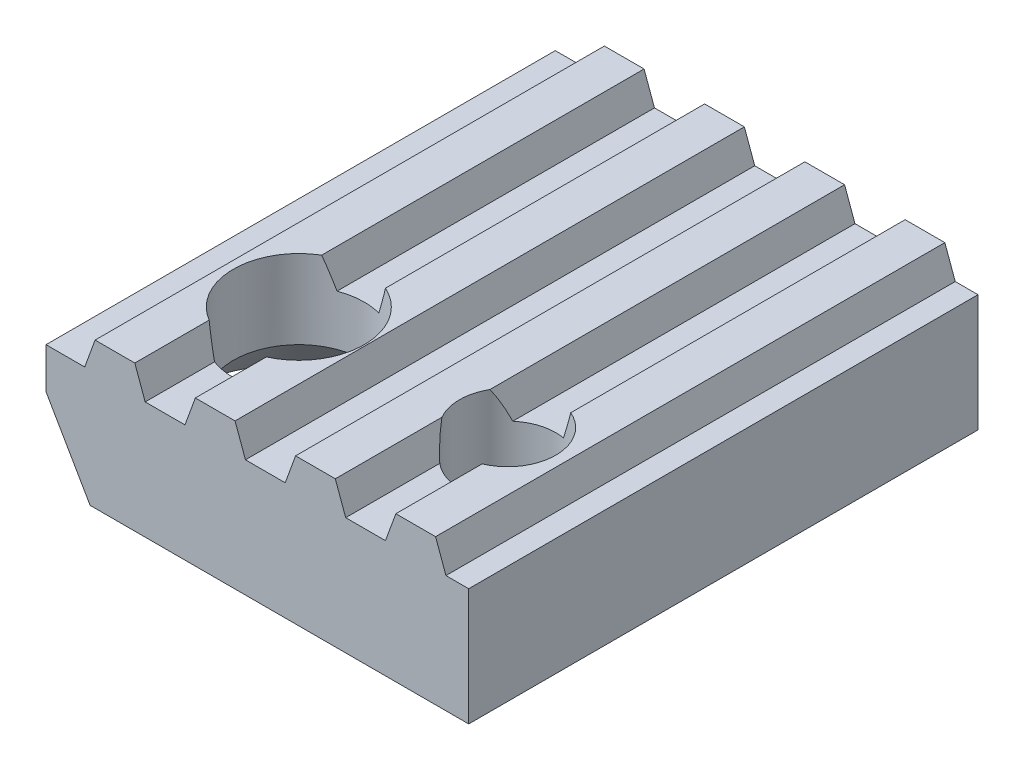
ISO-10303-21;
HEADER;
FILE_DESCRIPTION(('STEP AP214'),'2;1');
FILE_NAME('part.step','',(''),(''),'','','');
FILE_SCHEMA(('AUTOMOTIVE_DESIGN { 1 0 10303 214 1 1 1 1 }'));
ENDSEC;
DATA;
#1=APPLICATION_CONTEXT('core data for automotive mechanical design processes');
#2=APPLICATION_PROTOCOL_DEFINITION('international standard','automotive_design',2000,#1);
#3=PRODUCT_CONTEXT('',#1,'mechanical');
#4=PRODUCT('Part','Part','',(#3));
#5=PRODUCT_RELATED_PRODUCT_CATEGORY('part','',(#4));
#6=PRODUCT_DEFINITION_FORMATION('','',#4);
#7=PRODUCT_DEFINITION_CONTEXT('part definition',#1,'design');
#8=PRODUCT_DEFINITION('design','',#6,#7);
#9=PRODUCT_DEFINITION_SHAPE('','',#8);
#10=(LENGTH_UNIT() NAMED_UNIT(*) SI_UNIT(.MILLI.,.METRE.));
#11=(NAMED_UNIT(*) PLANE_ANGLE_UNIT() SI_UNIT($,.RADIAN.));
#12=(NAMED_UNIT(*) SI_UNIT($,.STERADIAN.) SOLID_ANGLE_UNIT());
#13=UNCERTAINTY_MEASURE_WITH_UNIT(LENGTH_MEASURE(1.E-05),#10,'distance_accuracy_value','');
#14=(GEOMETRIC_REPRESENTATION_CONTEXT(3) GLOBAL_UNCERTAINTY_ASSIGNED_CONTEXT((#13)) GLOBAL_UNIT_ASSIGNED_CONTEXT((#10,
#11,#12)) REPRESENTATION_CONTEXT('',''));
#15=CARTESIAN_POINT('',(0.,0.,0.));
#16=DIRECTION('',(0.,0.,1.));
#17=DIRECTION('',(1.,0.,0.));
#18=AXIS2_PLACEMENT_3D('',#15,#16,#17);
#19=CARTESIAN_POINT('',(0.,0.,12.7));
#20=DIRECTION('',(0.,1.,0.));
#21=DIRECTION('',(0.,0.,0.999999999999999));
#22=AXIS2_PLACEMENT_3D('',#19,#20,#21);
#23=PLANE('',#22);
#24=CARTESIAN_POINT('',(3.04799999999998,0.,9.44359999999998));
#25=DIRECTION('',(0.,1.,0.));
#26=DIRECTION('',(0.,0.,0.999999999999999));
#27=AXIS2_PLACEMENT_3D('',#24,#25,#26);
#28=CIRCLE('',#27,1.63195);
#29=CARTESIAN_POINT('',(3.46520000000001,0.,7.86587855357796));
#30=VERTEX_POINT('',#29);
#31=CARTESIAN_POINT('',(2.47351126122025,0.,7.91611072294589));
#32=VERTEX_POINT('',#31);
#33=EDGE_CURVE('E276',#30,#32,#28,.T.);
#34=ORIENTED_EDGE('',*,*,#33,.F.);
#35=DIRECTION('',(0.,0.,-0.999999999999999));
#36=VECTOR('',#35,1.);
#37=CARTESIAN_POINT('',(3.46519999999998,0.,12.7));
#38=LINE('',#37,#36);
#39=CARTESIAN_POINT('',(3.4652,0.,0.));
#40=VERTEX_POINT('',#39);
#41=EDGE_CURVE('E520',#30,#40,#38,.T.);
#42=ORIENTED_EDGE('',*,*,#41,.T.);
#43=DIRECTION('',(-1.,0.,0.));
#44=VECTOR('',#43,1.);
#45=CARTESIAN_POINT('',(0.,0.,0.));
#46=LINE('',#45,#44);
#47=CARTESIAN_POINT('',(2.47351126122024,0.,0.));
#48=VERTEX_POINT('',#47);
#49=EDGE_CURVE('E567',#40,#48,#46,.T.);
#50=ORIENTED_EDGE('',*,*,#49,.T.);
#51=DIRECTION('',(0.,0.,-0.999999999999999));
#52=VECTOR('',#51,1.);
#53=CARTESIAN_POINT('',(2.47351126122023,0.,12.7));
#54=LINE('',#53,#52);
#55=EDGE_CURVE('E292',#32,#48,#54,.T.);
#56=ORIENTED_EDGE('',*,*,#55,.F.);
#57=EDGE_LOOP('',(#34,#42,#50,#56));
#58=FACE_BOUND('',#57,.T.);
#59=ADVANCED_FACE('F67',(#58),#23,.T.);
#60=CARTESIAN_POINT('',(2.21465563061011,0.711200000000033,12.7));
#61=DIRECTION('',(-0.93969262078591,-0.342020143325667,0.));
#62=DIRECTION('',(0.342020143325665,-0.939692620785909,0.));
#63=AXIS2_PLACEMENT_3D('',#60,#61,#62);
#64=PLANE('',#63);
#65=CARTESIAN_POINT('',(2.47351126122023,0.,12.7));
#66=VERTEX_POINT('',#65);
#67=CARTESIAN_POINT('',(2.47351126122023,0.,10.9710892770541));
#68=VERTEX_POINT('',#67);
#69=EDGE_CURVE('E283',#66,#68,#54,.T.);
#70=ORIENTED_EDGE('',*,*,#69,.T.);
#71=CARTESIAN_POINT('',(3.04799999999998,-1.57839483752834,9.44359999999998));
#72=DIRECTION('',(-0.93969262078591,-0.342020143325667,0.));
#73=DIRECTION('',(0.342020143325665,-0.939692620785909,0.));
#74=AXIS2_PLACEMENT_3D('',#71,#72,#73);
#75=ELLIPSE('',#74,4.77150259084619,1.63195);
#76=CARTESIAN_POINT('',(2.21465563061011,0.711200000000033,10.8467386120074));
#77=VERTEX_POINT('',#76);
#78=EDGE_CURVE('E265',#68,#77,#75,.T.);
#79=ORIENTED_EDGE('',*,*,#78,.T.);
#80=DIRECTION('',(0.,0.,-0.999999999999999));
#81=VECTOR('',#80,1.);
#82=CARTESIAN_POINT('',(2.21465563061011,0.711200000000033,12.7));
#83=LINE('',#82,#81);
#84=CARTESIAN_POINT('',(2.21465563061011,0.711200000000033,12.7));
#85=VERTEX_POINT('',#84);
#86=EDGE_CURVE('E297',#85,#77,#83,.T.);
#87=ORIENTED_EDGE('',*,*,#86,.F.);
#88=DIRECTION('',(-0.342020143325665,0.939692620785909,0.));
#89=VECTOR('',#88,1.);
#90=CARTESIAN_POINT('',(2.21465563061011,0.711200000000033,12.7));
#91=LINE('',#90,#89);
#92=EDGE_CURVE('E290',#66,#85,#91,.T.);
#93=ORIENTED_EDGE('',*,*,#92,.F.);
#94=EDGE_LOOP('',(#70,#79,#87,#93));
#95=FACE_BOUND('',#94,.T.);
#96=ADVANCED_FACE('F289',(#95),#64,.F.);
#97=CARTESIAN_POINT('',(3.46519999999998,0.,12.7));
#98=DIRECTION('',(0.939692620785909,-0.342020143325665,0.));
#99=DIRECTION('',(0.342020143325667,0.93969262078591,0.));
#100=AXIS2_PLACEMENT_3D('',#97,#98,#99);
#101=PLANE('',#100);
#102=ORIENTED_EDGE('',*,*,#41,.F.);
#103=CARTESIAN_POINT('',(3.04799999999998,-1.14624757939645,9.44359999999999));
#104=DIRECTION('',(0.939692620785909,-0.342020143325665,0.));
#105=DIRECTION('',(-0.342020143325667,-0.93969262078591,0.));
#106=AXIS2_PLACEMENT_3D('',#103,#104,#105);
#107=ELLIPSE('',#106,4.77150259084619,1.63195);
#108=CARTESIAN_POINT('',(3.72405563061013,0.711200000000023,7.95826852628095));
#109=VERTEX_POINT('',#108);
#110=EDGE_CURVE('E316',#30,#109,#107,.T.);
#111=ORIENTED_EDGE('',*,*,#110,.T.);
#112=DIRECTION('',(0.,0.,-0.999999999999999));
#113=VECTOR('',#112,1.);
#114=CARTESIAN_POINT('',(3.72405563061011,0.71120000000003,12.7));
#115=LINE('',#114,#113);
#116=CARTESIAN_POINT('',(3.72405563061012,0.711200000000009,0.));
#117=VERTEX_POINT('',#116);
#118=EDGE_CURVE('E522',#109,#117,#115,.T.);
#119=ORIENTED_EDGE('',*,*,#118,.T.);
#120=DIRECTION('',(-0.342020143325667,-0.93969262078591,0.));
#121=VECTOR('',#120,1.);
#122=CARTESIAN_POINT('',(3.4652,0.,0.));
#123=LINE('',#122,#121);
#124=EDGE_CURVE('E510',#117,#40,#123,.T.);
#125=ORIENTED_EDGE('',*,*,#124,.T.);
#126=EDGE_LOOP('',(#102,#111,#119,#125));
#127=FACE_BOUND('',#126,.T.);
#128=ADVANCED_FACE('F374',(#127),#101,.F.);
#129=CARTESIAN_POINT('',(8.25499999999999,0.,9.44359999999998));
#130=DIRECTION('',(0.,1.,0.));
#131=DIRECTION('',(0.,0.,0.999999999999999));
#132=AXIS2_PLACEMENT_3D('',#129,#130,#131);
#133=CIRCLE('',#132,1.20015);
#134=CARTESIAN_POINT('',(8.4652,0.,8.26200109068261));
#135=VERTEX_POINT('',#134);
#136=CARTESIAN_POINT('',(7.47351126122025,0.,8.53275677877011));
#137=VERTEX_POINT('',#136);
#138=EDGE_CURVE('E611',#135,#137,#133,.T.);
#139=ORIENTED_EDGE('',*,*,#138,.F.);
#140=DIRECTION('',(0.,0.,-0.999999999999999));
#141=VECTOR('',#140,1.);
#142=CARTESIAN_POINT('',(8.46519999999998,0.,12.7));
#143=LINE('',#142,#141);
#144=CARTESIAN_POINT('',(8.4652,0.,0.));
#145=VERTEX_POINT('',#144);
#146=EDGE_CURVE('E880',#135,#145,#143,.T.);
#147=ORIENTED_EDGE('',*,*,#146,.T.);
#148=CARTESIAN_POINT('',(7.47351126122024,0.,0.));
#149=VERTEX_POINT('',#148);
#150=EDGE_CURVE('E457',#145,#149,#46,.T.);
#151=ORIENTED_EDGE('',*,*,#150,.T.);
#152=DIRECTION('',(0.,0.,-0.999999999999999));
#153=VECTOR('',#152,1.);
#154=CARTESIAN_POINT('',(7.47351126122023,0.,12.7));
#155=LINE('',#154,#153);
#156=EDGE_CURVE('E501',#137,#149,#155,.T.);
#157=ORIENTED_EDGE('',*,*,#156,.F.);
#158=EDGE_LOOP('',(#139,#147,#151,#157));
#159=FACE_BOUND('',#158,.T.);
#160=ADVANCED_FACE('F424',(#159),#23,.T.);
#161=CARTESIAN_POINT('',(7.2146556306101,0.71120000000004,12.7));
#162=DIRECTION('',(-0.93969262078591,-0.342020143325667,0.));
#163=DIRECTION('',(0.342020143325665,-0.939692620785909,0.));
#164=AXIS2_PLACEMENT_3D('',#161,#162,#163);
#165=PLANE('',#164);
#166=CARTESIAN_POINT('',(7.47351126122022,0.,12.7));
#167=VERTEX_POINT('',#166);
#168=CARTESIAN_POINT('',(7.47351126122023,0.,10.3544432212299));
#169=VERTEX_POINT('',#168);
#170=EDGE_CURVE('E502',#167,#169,#155,.T.);
#171=ORIENTED_EDGE('',*,*,#170,.T.);
#172=CARTESIAN_POINT('',(8.25499999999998,-2.14712266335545,9.44359999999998));
#173=DIRECTION('',(-0.93969262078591,-0.342020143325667,0.));
#174=DIRECTION('',(0.342020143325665,-0.939692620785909,0.));
#175=AXIS2_PLACEMENT_3D('',#172,#173,#174);
#176=ELLIPSE('',#175,3.50900385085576,1.20015);
#177=CARTESIAN_POINT('',(7.2146556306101,0.71120000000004,10.0419674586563));
#178=VERTEX_POINT('',#177);
#179=EDGE_CURVE('E613',#169,#178,#176,.T.);
#180=ORIENTED_EDGE('',*,*,#179,.T.);
#181=DIRECTION('',(0.,0.,-0.999999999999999));
#182=VECTOR('',#181,1.);
#183=CARTESIAN_POINT('',(7.2146556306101,0.71120000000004,12.7));
#184=LINE('',#183,#182);
#185=CARTESIAN_POINT('',(7.2146556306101,0.71120000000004,12.7));
#186=VERTEX_POINT('',#185);
#187=EDGE_CURVE('E498',#186,#178,#184,.T.);
#188=ORIENTED_EDGE('',*,*,#187,.F.);
#189=DIRECTION('',(-0.342020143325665,0.939692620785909,0.));
#190=VECTOR('',#189,1.);
#191=CARTESIAN_POINT('',(7.2146556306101,0.71120000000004,12.7));
#192=LINE('',#191,#190);
#193=EDGE_CURVE('E484',#167,#186,#192,.T.);
#194=ORIENTED_EDGE('',*,*,#193,.F.);
#195=EDGE_LOOP('',(#171,#180,#188,#194));
#196=FACE_BOUND('',#195,.T.);
#197=ADVANCED_FACE('F369',(#196),#165,.F.);
#198=CARTESIAN_POINT('',(8.46519999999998,0.,12.7));
#199=DIRECTION('',(0.939692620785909,-0.342020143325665,0.));
#200=DIRECTION('',(0.342020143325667,0.93969262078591,0.));
#201=AXIS2_PLACEMENT_3D('',#198,#199,#200);
#202=PLANE('',#201);
#203=ORIENTED_EDGE('',*,*,#146,.F.);
#204=CARTESIAN_POINT('',(8.25499999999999,-0.577519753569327,9.44359999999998));
#205=DIRECTION('',(0.939692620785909,-0.342020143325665,0.));
#206=DIRECTION('',(-0.342020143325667,-0.93969262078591,0.));
#207=AXIS2_PLACEMENT_3D('',#204,#205,#206);
#208=ELLIPSE('',#207,3.50900385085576,1.20015);
#209=CARTESIAN_POINT('',(8.72405563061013,0.711200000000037,8.33890690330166));
#210=VERTEX_POINT('',#209);
#211=EDGE_CURVE('E295',#135,#210,#208,.T.);
#212=ORIENTED_EDGE('',*,*,#211,.T.);
#213=DIRECTION('',(0.,0.,-0.999999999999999));
#214=VECTOR('',#213,1.);
#215=CARTESIAN_POINT('',(8.7240556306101,0.711200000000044,12.7));
#216=LINE('',#215,#214);
#217=CARTESIAN_POINT('',(8.72405563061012,0.711200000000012,0.));
#218=VERTEX_POINT('',#217);
#219=EDGE_CURVE('E886',#210,#218,#216,.T.);
#220=ORIENTED_EDGE('',*,*,#219,.T.);
#221=DIRECTION('',(-0.342020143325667,-0.93969262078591,0.));
#222=VECTOR('',#221,1.);
#223=CARTESIAN_POINT('',(8.4652,0.,0.));
#224=LINE('',#223,#222);
#225=EDGE_CURVE('E874',#218,#145,#224,.T.);
#226=ORIENTED_EDGE('',*,*,#225,.T.);
#227=EDGE_LOOP('',(#203,#212,#220,#226));
#228=FACE_BOUND('',#227,.T.);
#229=ADVANCED_FACE('F348',(#228),#202,.F.);
#230=CARTESIAN_POINT('',(10.541,0.,0.));
#231=VERTEX_POINT('',#230);
#232=CARTESIAN_POINT('',(9.97351126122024,0.,0.));
#233=VERTEX_POINT('',#232);
#234=EDGE_CURVE('E449',#231,#233,#46,.T.);
#235=ORIENTED_EDGE('',*,*,#234,.T.);
#236=DIRECTION('',(0.,0.,-0.999999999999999));
#237=VECTOR('',#236,1.);
#238=CARTESIAN_POINT('',(9.97351126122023,0.,12.7));
#239=LINE('',#238,#237);
#240=CARTESIAN_POINT('',(9.97351126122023,0.,12.7));
#241=VERTEX_POINT('',#240);
#242=EDGE_CURVE('E452',#241,#233,#239,.T.);
#243=ORIENTED_EDGE('',*,*,#242,.F.);
#244=DIRECTION('',(1.,0.,0.));
#245=VECTOR('',#244,1.);
#246=CARTESIAN_POINT('',(0.,0.,12.7));
#247=LINE('',#246,#245);
#248=CARTESIAN_POINT('',(10.541,0.,12.7));
#249=VERTEX_POINT('',#248);
#250=EDGE_CURVE('E534',#241,#249,#247,.T.);
#251=ORIENTED_EDGE('',*,*,#250,.T.);
#252=DIRECTION('',(0.,0.,-0.999999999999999));
#253=VECTOR('',#252,1.);
#254=CARTESIAN_POINT('',(10.541,0.,0.));
#255=LINE('',#254,#253);
#256=EDGE_CURVE('E455',#249,#231,#255,.T.);
#257=ORIENTED_EDGE('',*,*,#256,.T.);
#258=EDGE_LOOP('',(#235,#243,#251,#257));
#259=FACE_BOUND('',#258,.T.);
#260=ADVANCED_FACE('F430',(#259),#23,.T.);
#261=CARTESIAN_POINT('',(8.46519999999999,0.,10.6251989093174));
#262=VERTEX_POINT('',#261);
#263=EDGE_CURVE('E606',#169,#262,#133,.T.);
#264=ORIENTED_EDGE('',*,*,#263,.F.);
#265=ORIENTED_EDGE('',*,*,#170,.F.);
#266=CARTESIAN_POINT('',(8.46519999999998,0.,12.7));
#267=VERTEX_POINT('',#266);
#268=EDGE_CURVE('E552',#167,#267,#247,.T.);
#269=ORIENTED_EDGE('',*,*,#268,.T.);
#270=EDGE_CURVE('E884',#267,#262,#143,.T.);
#271=ORIENTED_EDGE('',*,*,#270,.T.);
#272=EDGE_LOOP('',(#264,#265,#269,#271));
#273=FACE_BOUND('',#272,.T.);
#274=ADVANCED_FACE('F439',(#273),#23,.T.);
#275=CARTESIAN_POINT('',(4.97351126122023,0.,12.7));
#276=VERTEX_POINT('',#275);
#277=CARTESIAN_POINT('',(5.96519999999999,0.,12.7));
#278=VERTEX_POINT('',#277);
#279=EDGE_CURVE('E549',#276,#278,#247,.T.);
#280=ORIENTED_EDGE('',*,*,#279,.T.);
#281=DIRECTION('',(0.,0.,-0.999999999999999));
#282=VECTOR('',#281,1.);
#283=CARTESIAN_POINT('',(5.96519999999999,0.,12.7));
#284=LINE('',#283,#282);
#285=CARTESIAN_POINT('',(5.9652,0.,0.));
#286=VERTEX_POINT('',#285);
#287=EDGE_CURVE('E491',#278,#286,#284,.T.);
#288=ORIENTED_EDGE('',*,*,#287,.T.);
#289=CARTESIAN_POINT('',(4.97351126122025,0.,0.));
#290=VERTEX_POINT('',#289);
#291=EDGE_CURVE('E555',#286,#290,#46,.T.);
#292=ORIENTED_EDGE('',*,*,#291,.T.);
#293=DIRECTION('',(0.,0.,-0.999999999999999));
#294=VECTOR('',#293,1.);
#295=CARTESIAN_POINT('',(4.97351126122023,0.,12.7));
#296=LINE('',#295,#294);
#297=EDGE_CURVE('E528',#276,#290,#296,.T.);
#298=ORIENTED_EDGE('',*,*,#297,.F.);
#299=EDGE_LOOP('',(#280,#288,#292,#298));
#300=FACE_BOUND('',#299,.T.);
#301=ADVANCED_FACE('F419',(#300),#23,.T.);
#302=CARTESIAN_POINT('',(3.46519999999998,0.,11.021321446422));
#303=VERTEX_POINT('',#302);
#304=EDGE_CURVE('E268',#68,#303,#28,.T.);
#305=ORIENTED_EDGE('',*,*,#304,.F.);
#306=ORIENTED_EDGE('',*,*,#69,.F.);
#307=CARTESIAN_POINT('',(3.46519999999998,0.,12.7));
#308=VERTEX_POINT('',#307);
#309=EDGE_CURVE('E541',#66,#308,#247,.T.);
#310=ORIENTED_EDGE('',*,*,#309,.T.);
#311=EDGE_CURVE('E286',#308,#303,#38,.T.);
#312=ORIENTED_EDGE('',*,*,#311,.T.);
#313=EDGE_LOOP('',(#305,#306,#310,#312));
#314=FACE_BOUND('',#313,.T.);
#315=ADVANCED_FACE('F282',(#314),#23,.T.);
#316=CARTESIAN_POINT('',(2.21465563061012,0.711200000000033,8.04046138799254));
#317=VERTEX_POINT('',#316);
#318=CARTESIAN_POINT('',(2.21465563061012,0.711200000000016,0.));
#319=VERTEX_POINT('',#318);
#320=EDGE_CURVE('E860',#317,#319,#83,.T.);
#321=ORIENTED_EDGE('',*,*,#320,.F.);
#322=EDGE_CURVE('E278',#317,#32,#75,.T.);
#323=ORIENTED_EDGE('',*,*,#322,.T.);
#324=ORIENTED_EDGE('',*,*,#55,.T.);
#325=DIRECTION('',(-0.342020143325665,0.939692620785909,0.));
#326=VECTOR('',#325,1.);
#327=CARTESIAN_POINT('',(2.21465563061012,0.711200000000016,0.));
#328=LINE('',#327,#326);
#329=EDGE_CURVE('E304',#48,#319,#328,.T.);
#330=ORIENTED_EDGE('',*,*,#329,.T.);
#331=EDGE_LOOP('',(#321,#323,#324,#330));
#332=FACE_BOUND('',#331,.T.);
#333=ADVANCED_FACE('F412',(#332),#64,.F.);
#334=CARTESIAN_POINT('',(1.2240556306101,0.711200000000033,12.7));
#335=DIRECTION('',(0.,-1.,0.));
#336=DIRECTION('',(0.,0.,-0.999999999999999));
#337=AXIS2_PLACEMENT_3D('',#334,#335,#336);
#338=PLANE('',#337);
#339=ORIENTED_EDGE('',*,*,#86,.T.);
#340=CARTESIAN_POINT('',(3.04799999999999,0.711200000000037,9.44359999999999));
#341=DIRECTION('',(0.,-1.,0.));
#342=DIRECTION('',(0.,0.,-0.999999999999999));
#343=AXIS2_PLACEMENT_3D('',#340,#341,#342);
#344=CIRCLE('',#343,1.63195);
#345=EDGE_CURVE('E271',#77,#317,#344,.T.);
#346=ORIENTED_EDGE('',*,*,#345,.T.);
#347=ORIENTED_EDGE('',*,*,#320,.T.);
#348=DIRECTION('',(-1.,0.,0.));
#349=VECTOR('',#348,1.);
#350=CARTESIAN_POINT('',(1.22405563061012,0.711200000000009,0.));
#351=LINE('',#350,#349);
#352=CARTESIAN_POINT('',(1.22405563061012,0.711200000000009,0.));
#353=VERTEX_POINT('',#352);
#354=EDGE_CURVE('E838',#319,#353,#351,.T.);
#355=ORIENTED_EDGE('',*,*,#354,.T.);
#356=DIRECTION('',(0.,0.,-0.999999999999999));
#357=VECTOR('',#356,1.);
#358=CARTESIAN_POINT('',(1.2240556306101,0.711200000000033,12.7));
#359=LINE('',#358,#357);
#360=CARTESIAN_POINT('',(1.2240556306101,0.711200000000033,12.7));
#361=VERTEX_POINT('',#360);
#362=EDGE_CURVE('E859',#361,#353,#359,.T.);
#363=ORIENTED_EDGE('',*,*,#362,.F.);
#364=DIRECTION('',(-1.,0.,0.));
#365=VECTOR('',#364,1.);
#366=CARTESIAN_POINT('',(1.2240556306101,0.711200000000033,12.7));
#367=LINE('',#366,#365);
#368=EDGE_CURVE('E853',#85,#361,#367,.T.);
#369=ORIENTED_EDGE('',*,*,#368,.F.);
#370=EDGE_LOOP('',(#339,#346,#347,#355,#363,#369));
#371=FACE_BOUND('',#370,.T.);
#372=ADVANCED_FACE('F409',(#371),#338,.F.);
#373=CARTESIAN_POINT('',(0.965199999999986,0.,12.7));
#374=DIRECTION('',(0.939692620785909,-0.342020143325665,0.));
#375=DIRECTION('',(0.342020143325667,0.93969262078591,0.));
#376=AXIS2_PLACEMENT_3D('',#373,#374,#375);
#377=PLANE('',#376);
#378=DIRECTION('',(-0.342020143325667,-0.93969262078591,0.));
#379=VECTOR('',#378,1.);
#380=CARTESIAN_POINT('',(0.965200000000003,0.,0.));
#381=LINE('',#380,#379);
#382=CARTESIAN_POINT('',(0.965200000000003,0.,0.));
#383=VERTEX_POINT('',#382);
#384=EDGE_CURVE('E858',#353,#383,#381,.T.);
#385=ORIENTED_EDGE('',*,*,#384,.T.);
#386=DIRECTION('',(0.,0.,-0.999999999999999));
#387=VECTOR('',#386,1.);
#388=CARTESIAN_POINT('',(0.965199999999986,0.,12.7));
#389=LINE('',#388,#387);
#390=CARTESIAN_POINT('',(0.965199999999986,0.,12.7));
#391=VERTEX_POINT('',#390);
#392=EDGE_CURVE('E310',#391,#383,#389,.T.);
#393=ORIENTED_EDGE('',*,*,#392,.F.);
#394=DIRECTION('',(-0.342020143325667,-0.93969262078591,0.));
#395=VECTOR('',#394,1.);
#396=CARTESIAN_POINT('',(0.965199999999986,0.,12.7));
#397=LINE('',#396,#395);
#398=EDGE_CURVE('E850',#361,#391,#397,.T.);
#399=ORIENTED_EDGE('',*,*,#398,.F.);
#400=ORIENTED_EDGE('',*,*,#362,.T.);
#401=EDGE_LOOP('',(#385,#393,#399,#400));
#402=FACE_BOUND('',#401,.T.);
#403=ADVANCED_FACE('F405',(#402),#377,.F.);
#404=CARTESIAN_POINT('',(0.965199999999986,0.,12.7));
#405=DIRECTION('',(0.,0.,0.999999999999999));
#406=DIRECTION('',(1.,0.,0.));
#407=AXIS2_PLACEMENT_3D('',#404,#405,#406);
#408=PLANE('',#407);
#409=DIRECTION('',(0.,1.,0.));
#410=VECTOR('',#409,1.);
#411=CARTESIAN_POINT('',(0.,-2.92099999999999,12.7));
#412=LINE('',#411,#410);
#413=CARTESIAN_POINT('',(0.,-1.01599999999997,12.7));
#414=VERTEX_POINT('',#413);
#415=CARTESIAN_POINT('',(0.,0.,12.7));
#416=VERTEX_POINT('',#415);
#417=EDGE_CURVE('E844',#414,#416,#412,.T.);
#418=ORIENTED_EDGE('',*,*,#417,.F.);
#419=DIRECTION('',(0.499999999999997,-0.86602540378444,0.));
#420=VECTOR('',#419,1.);
#421=CARTESIAN_POINT('',(-0.198640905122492,-0.671943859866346,12.7));
#422=LINE('',#421,#420);
#423=CARTESIAN_POINT('',(1.09985226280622,-2.92099999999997,12.7));
#424=VERTEX_POINT('',#423);
#425=EDGE_CURVE('E326',#414,#424,#422,.T.);
#426=ORIENTED_EDGE('',*,*,#425,.T.);
#427=DIRECTION('',(1.,0.,0.));
#428=VECTOR('',#427,1.);
#429=CARTESIAN_POINT('',(0.,-2.92099999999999,12.7));
#430=LINE('',#429,#428);
#431=CARTESIAN_POINT('',(10.541,-2.92099999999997,12.7));
#432=VERTEX_POINT('',#431);
#433=EDGE_CURVE('E456',#424,#432,#430,.T.);
#434=ORIENTED_EDGE('',*,*,#433,.T.);
#435=DIRECTION('',(0.,1.,0.));
#436=VECTOR('',#435,1.);
#437=CARTESIAN_POINT('',(10.541,-2.92099999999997,12.7));
#438=LINE('',#437,#436);
#439=EDGE_CURVE('E839',#432,#249,#438,.T.);
#440=ORIENTED_EDGE('',*,*,#439,.T.);
#441=ORIENTED_EDGE('',*,*,#250,.F.);
#442=DIRECTION('',(-0.342020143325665,0.939692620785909,0.));
#443=VECTOR('',#442,1.);
#444=CARTESIAN_POINT('',(9.71465563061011,0.71120000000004,12.7));
#445=LINE('',#444,#443);
#446=CARTESIAN_POINT('',(9.71465563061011,0.71120000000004,12.7));
#447=VERTEX_POINT('',#446);
#448=EDGE_CURVE('E469',#241,#447,#445,.T.);
#449=ORIENTED_EDGE('',*,*,#448,.T.);
#450=DIRECTION('',(-1.,0.,0.));
#451=VECTOR('',#450,1.);
#452=CARTESIAN_POINT('',(8.7240556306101,0.711200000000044,12.7));
#453=LINE('',#452,#451);
#454=CARTESIAN_POINT('',(8.7240556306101,0.711200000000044,12.7));
#455=VERTEX_POINT('',#454);
#456=EDGE_CURVE('E872',#447,#455,#453,.T.);
#457=ORIENTED_EDGE('',*,*,#456,.T.);
#458=DIRECTION('',(-0.342020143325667,-0.93969262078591,0.));
#459=VECTOR('',#458,1.);
#460=CARTESIAN_POINT('',(8.46519999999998,0.,12.7));
#461=LINE('',#460,#459);
#462=EDGE_CURVE('E878',#455,#267,#461,.T.);
#463=ORIENTED_EDGE('',*,*,#462,.T.);
#464=ORIENTED_EDGE('',*,*,#268,.F.);
#465=ORIENTED_EDGE('',*,*,#193,.T.);
#466=DIRECTION('',(-1.,0.,0.));
#467=VECTOR('',#466,1.);
#468=CARTESIAN_POINT('',(6.22405563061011,0.711200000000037,12.7));
#469=LINE('',#468,#467);
#470=CARTESIAN_POINT('',(6.22405563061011,0.711200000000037,12.7));
#471=VERTEX_POINT('',#470);
#472=EDGE_CURVE('E486',#186,#471,#469,.T.);
#473=ORIENTED_EDGE('',*,*,#472,.T.);
#474=DIRECTION('',(-0.342020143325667,-0.93969262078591,0.));
#475=VECTOR('',#474,1.);
#476=CARTESIAN_POINT('',(5.96519999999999,0.,12.7));
#477=LINE('',#476,#475);
#478=EDGE_CURVE('E488',#471,#278,#477,.T.);
#479=ORIENTED_EDGE('',*,*,#478,.T.);
#480=ORIENTED_EDGE('',*,*,#279,.F.);
#481=DIRECTION('',(-0.342020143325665,0.939692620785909,0.));
#482=VECTOR('',#481,1.);
#483=CARTESIAN_POINT('',(4.71465563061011,0.71120000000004,12.7));
#484=LINE('',#483,#482);
#485=CARTESIAN_POINT('',(4.71465563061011,0.71120000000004,12.7));
#486=VERTEX_POINT('',#485);
#487=EDGE_CURVE('E513',#276,#486,#484,.T.);
#488=ORIENTED_EDGE('',*,*,#487,.T.);
#489=DIRECTION('',(-1.,0.,0.));
#490=VECTOR('',#489,1.);
#491=CARTESIAN_POINT('',(3.72405563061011,0.71120000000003,12.7));
#492=LINE('',#491,#490);
#493=CARTESIAN_POINT('',(3.72405563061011,0.71120000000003,12.7));
#494=VERTEX_POINT('',#493);
#495=EDGE_CURVE('E515',#486,#494,#492,.T.);
#496=ORIENTED_EDGE('',*,*,#495,.T.);
#497=DIRECTION('',(-0.342020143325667,-0.93969262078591,0.));
#498=VECTOR('',#497,1.);
#499=CARTESIAN_POINT('',(3.46519999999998,0.,12.7));
#500=LINE('',#499,#498);
#501=EDGE_CURVE('E517',#494,#308,#500,.T.);
#502=ORIENTED_EDGE('',*,*,#501,.T.);
#503=ORIENTED_EDGE('',*,*,#309,.F.);
#504=ORIENTED_EDGE('',*,*,#92,.T.);
#505=ORIENTED_EDGE('',*,*,#368,.T.);
#506=ORIENTED_EDGE('',*,*,#398,.T.);
#507=EDGE_CURVE('E546',#416,#391,#247,.T.);
#508=ORIENTED_EDGE('',*,*,#507,.F.);
#509=EDGE_LOOP('',(#418,#426,#434,#440,#441,#449,#457,#463,#464,#465,#473,#479,#480,#488,#496,
#502,#503,#504,#505,#506,#508));
#510=FACE_BOUND('',#509,.T.);
#511=ADVANCED_FACE('F401',(#510),#408,.T.);
#512=CARTESIAN_POINT('',(0.965200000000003,0.,0.));
#513=DIRECTION('',(0.,0.,0.999999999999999));
#514=DIRECTION('',(1.,0.,0.));
#515=AXIS2_PLACEMENT_3D('',#512,#513,#514);
#516=PLANE('',#515);
#517=DIRECTION('',(-1.,0.,0.));
#518=VECTOR('',#517,1.);
#519=CARTESIAN_POINT('',(0.,-2.92100000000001,0.));
#520=LINE('',#519,#518);
#521=CARTESIAN_POINT('',(10.541,-2.92099999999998,0.));
#522=VERTEX_POINT('',#521);
#523=CARTESIAN_POINT('',(1.09985226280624,-2.92099999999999,0.));
#524=VERTEX_POINT('',#523);
#525=EDGE_CURVE('E834',#522,#524,#520,.T.);
#526=ORIENTED_EDGE('',*,*,#525,.T.);
#527=DIRECTION('',(-0.499999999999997,0.86602540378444,0.));
#528=VECTOR('',#527,1.);
#529=CARTESIAN_POINT('',(0.,-1.01599999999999,0.));
#530=LINE('',#529,#528);
#531=CARTESIAN_POINT('',(0.,-1.01599999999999,0.));
#532=VERTEX_POINT('',#531);
#533=EDGE_CURVE('E12',#524,#532,#530,.T.);
#534=ORIENTED_EDGE('',*,*,#533,.T.);
#535=DIRECTION('',(0.,1.,0.));
#536=VECTOR('',#535,1.);
#537=CARTESIAN_POINT('',(0.,-2.92100000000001,0.));
#538=LINE('',#537,#536);
#539=CARTESIAN_POINT('',(0.,0.,0.));
#540=VERTEX_POINT('',#539);
#541=EDGE_CURVE('E833',#532,#540,#538,.T.);
#542=ORIENTED_EDGE('',*,*,#541,.T.);
#543=EDGE_CURVE('E563',#383,#540,#46,.T.);
#544=ORIENTED_EDGE('',*,*,#543,.F.);
#545=ORIENTED_EDGE('',*,*,#384,.F.);
#546=ORIENTED_EDGE('',*,*,#354,.F.);
#547=ORIENTED_EDGE('',*,*,#329,.F.);
#548=ORIENTED_EDGE('',*,*,#49,.F.);
#549=ORIENTED_EDGE('',*,*,#124,.F.);
#550=DIRECTION('',(-1.,0.,0.));
#551=VECTOR('',#550,1.);
#552=CARTESIAN_POINT('',(3.72405563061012,0.711200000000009,0.));
#553=LINE('',#552,#551);
#554=CARTESIAN_POINT('',(4.71465563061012,0.711200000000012,0.));
#555=VERTEX_POINT('',#554);
#556=EDGE_CURVE('E507',#555,#117,#553,.T.);
#557=ORIENTED_EDGE('',*,*,#556,.F.);
#558=DIRECTION('',(-0.342020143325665,0.939692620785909,0.));
#559=VECTOR('',#558,1.);
#560=CARTESIAN_POINT('',(4.71465563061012,0.711200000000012,0.));
#561=LINE('',#560,#559);
#562=EDGE_CURVE('E505',#290,#555,#561,.T.);
#563=ORIENTED_EDGE('',*,*,#562,.F.);
#564=ORIENTED_EDGE('',*,*,#291,.F.);
#565=DIRECTION('',(-0.342020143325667,-0.93969262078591,0.));
#566=VECTOR('',#565,1.);
#567=CARTESIAN_POINT('',(5.9652,0.,0.));
#568=LINE('',#567,#566);
#569=CARTESIAN_POINT('',(6.22405563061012,0.711200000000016,0.));
#570=VERTEX_POINT('',#569);
#571=EDGE_CURVE('E481',#570,#286,#568,.T.);
#572=ORIENTED_EDGE('',*,*,#571,.F.);
#573=DIRECTION('',(-1.,0.,0.));
#574=VECTOR('',#573,1.);
#575=CARTESIAN_POINT('',(6.22405563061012,0.711200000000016,0.));
#576=LINE('',#575,#574);
#577=CARTESIAN_POINT('',(7.21465563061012,0.711200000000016,0.));
#578=VERTEX_POINT('',#577);
#579=EDGE_CURVE('E474',#578,#570,#576,.T.);
#580=ORIENTED_EDGE('',*,*,#579,.F.);
#581=DIRECTION('',(-0.342020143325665,0.939692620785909,0.));
#582=VECTOR('',#581,1.);
#583=CARTESIAN_POINT('',(7.21465563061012,0.711200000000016,0.));
#584=LINE('',#583,#582);
#585=EDGE_CURVE('E470',#149,#578,#584,.T.);
#586=ORIENTED_EDGE('',*,*,#585,.F.);
#587=ORIENTED_EDGE('',*,*,#150,.F.);
#588=ORIENTED_EDGE('',*,*,#225,.F.);
#589=DIRECTION('',(-1.,0.,0.));
#590=VECTOR('',#589,1.);
#591=CARTESIAN_POINT('',(8.72405563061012,0.711200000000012,0.));
#592=LINE('',#591,#590);
#593=CARTESIAN_POINT('',(9.71465563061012,0.711200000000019,0.));
#594=VERTEX_POINT('',#593);
#595=EDGE_CURVE('E463',#594,#218,#592,.T.);
#596=ORIENTED_EDGE('',*,*,#595,.F.);
#597=DIRECTION('',(-0.342020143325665,0.939692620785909,0.));
#598=VECTOR('',#597,1.);
#599=CARTESIAN_POINT('',(9.71465563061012,0.711200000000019,0.));
#600=LINE('',#599,#598);
#601=EDGE_CURVE('E460',#233,#594,#600,.T.);
#602=ORIENTED_EDGE('',*,*,#601,.F.);
#603=ORIENTED_EDGE('',*,*,#234,.F.);
#604=DIRECTION('',(0.,1.,0.));
#605=VECTOR('',#604,1.);
#606=CARTESIAN_POINT('',(10.541,-2.92099999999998,0.));
#607=LINE('',#606,#605);
#608=EDGE_CURVE('E835',#522,#231,#607,.T.);
#609=ORIENTED_EDGE('',*,*,#608,.F.);
#610=EDGE_LOOP('',(#526,#534,#542,#544,#545,#546,#547,#548,#549,#557,#563,#564,#572,#580,#586,
#587,#588,#596,#602,#603,#609));
#611=FACE_BOUND('',#610,.T.);
#612=ADVANCED_FACE('F397',(#611),#516,.F.);
#613=CARTESIAN_POINT('',(0.,-2.92100000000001,0.));
#614=DIRECTION('',(-1.,0.,0.));
#615=DIRECTION('',(0.,0.,0.999999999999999));
#616=AXIS2_PLACEMENT_3D('',#613,#614,#615);
#617=PLANE('',#616);
#618=ORIENTED_EDGE('',*,*,#541,.F.);
#619=DIRECTION('',(0.,0.,0.999999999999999));
#620=VECTOR('',#619,1.);
#621=CARTESIAN_POINT('',(0.,-1.01599999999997,9.01273988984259));
#622=LINE('',#621,#620);
#623=EDGE_CURVE('E323',#532,#414,#622,.T.);
#624=ORIENTED_EDGE('',*,*,#623,.T.);
#625=ORIENTED_EDGE('',*,*,#417,.T.);
#626=DIRECTION('',(0.,0.,0.999999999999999));
#627=VECTOR('',#626,1.);
#628=CARTESIAN_POINT('',(0.,0.,0.));
#629=LINE('',#628,#627);
#630=EDGE_CURVE('E531',#540,#416,#629,.T.);
#631=ORIENTED_EDGE('',*,*,#630,.F.);
#632=EDGE_LOOP('',(#618,#624,#625,#631));
#633=FACE_BOUND('',#632,.T.);
#634=ADVANCED_FACE('F393',(#633),#617,.T.);
#635=CARTESIAN_POINT('',(10.541,-2.92099999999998,0.));
#636=DIRECTION('',(1.,0.,0.));
#637=DIRECTION('',(0.,0.,-0.999999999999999));
#638=AXIS2_PLACEMENT_3D('',#635,#636,#637);
#639=PLANE('',#638);
#640=ORIENTED_EDGE('',*,*,#256,.F.);
#641=ORIENTED_EDGE('',*,*,#439,.F.);
#642=DIRECTION('',(0.,0.,-0.999999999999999));
#643=VECTOR('',#642,1.);
#644=CARTESIAN_POINT('',(10.541,-2.92099999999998,0.));
#645=LINE('',#644,#643);
#646=EDGE_CURVE('E845',#432,#522,#645,.T.);
#647=ORIENTED_EDGE('',*,*,#646,.T.);
#648=ORIENTED_EDGE('',*,*,#608,.T.);
#649=EDGE_LOOP('',(#640,#641,#647,#648));
#650=FACE_BOUND('',#649,.T.);
#651=ADVANCED_FACE('F389',(#650),#639,.T.);
#652=CARTESIAN_POINT('',(0.,-2.92099999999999,12.7));
#653=DIRECTION('',(0.,1.,0.));
#654=DIRECTION('',(0.,0.,0.999999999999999));
#655=AXIS2_PLACEMENT_3D('',#652,#653,#654);
#656=PLANE('',#655);
#657=CARTESIAN_POINT('',(8.25499999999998,-2.92099999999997,9.44359999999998));
#658=DIRECTION('',(0.,-1.,0.));
#659=DIRECTION('',(0.,0.,-0.999999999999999));
#660=AXIS2_PLACEMENT_3D('',#657,#658,#659);
#661=CIRCLE('',#660,1.20015);
#662=CARTESIAN_POINT('',(8.25499999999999,-2.92099999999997,8.24344999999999));
#663=VERTEX_POINT('',#662);
#664=EDGE_CURVE('E322',#663,#663,#661,.T.);
#665=ORIENTED_EDGE('',*,*,#664,.F.);
#666=EDGE_LOOP('',(#665));
#667=FACE_BOUND('',#666,.T.);
#668=ORIENTED_EDGE('',*,*,#433,.F.);
#669=DIRECTION('',(0.,0.,-0.999999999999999));
#670=VECTOR('',#669,1.);
#671=CARTESIAN_POINT('',(1.09985226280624,-2.92099999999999,0.));
#672=LINE('',#671,#670);
#673=CARTESIAN_POINT('',(1.09985226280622,-2.92099999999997,11.8270145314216));
#674=VERTEX_POINT('',#673);
#675=EDGE_CURVE('E89',#424,#674,#672,.T.);
#676=ORIENTED_EDGE('',*,*,#675,.T.);
#677=CARTESIAN_POINT('',(3.04799999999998,-2.92099999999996,9.44359999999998));
#678=DIRECTION('',(0.,-1.,0.));
#679=DIRECTION('',(0.,0.,-0.999999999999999));
#680=AXIS2_PLACEMENT_3D('',#677,#678,#679);
#681=CIRCLE('',#680,3.0783022);
#682=CARTESIAN_POINT('',(1.09985226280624,-2.92099999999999,7.06018546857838));
#683=VERTEX_POINT('',#682);
#684=EDGE_CURVE('E320',#683,#674,#681,.T.);
#685=ORIENTED_EDGE('',*,*,#684,.F.);
#686=DIRECTION('',(0.,0.,-0.999999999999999));
#687=VECTOR('',#686,1.);
#688=CARTESIAN_POINT('',(1.09985226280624,-2.92099999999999,0.));
#689=LINE('',#688,#687);
#690=EDGE_CURVE('E83',#683,#524,#689,.T.);
#691=ORIENTED_EDGE('',*,*,#690,.T.);
#692=ORIENTED_EDGE('',*,*,#525,.F.);
#693=ORIENTED_EDGE('',*,*,#646,.F.);
#694=EDGE_LOOP('',(#668,#676,#685,#691,#692,#693));
#695=FACE_BOUND('',#694,.T.);
#696=ADVANCED_FACE('F385',(#667,#695),#656,.F.);
#697=ORIENTED_EDGE('',*,*,#507,.T.);
#698=ORIENTED_EDGE('',*,*,#392,.T.);
#699=ORIENTED_EDGE('',*,*,#543,.T.);
#700=ORIENTED_EDGE('',*,*,#630,.T.);
#701=EDGE_LOOP('',(#697,#698,#699,#700));
#702=FACE_BOUND('',#701,.T.);
#703=ADVANCED_FACE('F381',(#702),#23,.T.);
#704=CARTESIAN_POINT('',(4.71465563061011,0.71120000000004,12.7));
#705=DIRECTION('',(-0.93969262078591,-0.342020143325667,0.));
#706=DIRECTION('',(0.342020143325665,-0.939692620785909,0.));
#707=AXIS2_PLACEMENT_3D('',#704,#705,#706);
#708=PLANE('',#707);
#709=ORIENTED_EDGE('',*,*,#562,.T.);
#710=DIRECTION('',(0.,0.,-0.999999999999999));
#711=VECTOR('',#710,1.);
#712=CARTESIAN_POINT('',(4.71465563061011,0.71120000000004,12.7));
#713=LINE('',#712,#711);
#714=EDGE_CURVE('E525',#486,#555,#713,.T.);
#715=ORIENTED_EDGE('',*,*,#714,.F.);
#716=ORIENTED_EDGE('',*,*,#487,.F.);
#717=ORIENTED_EDGE('',*,*,#297,.T.);
#718=EDGE_LOOP('',(#709,#715,#716,#717));
#719=FACE_BOUND('',#718,.T.);
#720=ADVANCED_FACE('F377',(#719),#708,.F.);
#721=CARTESIAN_POINT('',(3.72405563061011,0.71120000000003,12.7));
#722=DIRECTION('',(0.,-1.,0.));
#723=DIRECTION('',(0.,0.,-0.999999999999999));
#724=AXIS2_PLACEMENT_3D('',#721,#722,#723);
#725=PLANE('',#724);
#726=ORIENTED_EDGE('',*,*,#118,.F.);
#727=CARTESIAN_POINT('',(3.04799999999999,0.711200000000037,9.44359999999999));
#728=DIRECTION('',(0.,-1.,0.));
#729=DIRECTION('',(0.,0.,-0.999999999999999));
#730=AXIS2_PLACEMENT_3D('',#727,#728,#729);
#731=CIRCLE('',#730,1.63195);
#732=CARTESIAN_POINT('',(3.72405563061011,0.71120000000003,10.928931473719));
#733=VERTEX_POINT('',#732);
#734=EDGE_CURVE('E287',#109,#733,#731,.T.);
#735=ORIENTED_EDGE('',*,*,#734,.T.);
#736=EDGE_CURVE('E524',#494,#733,#115,.T.);
#737=ORIENTED_EDGE('',*,*,#736,.F.);
#738=ORIENTED_EDGE('',*,*,#495,.F.);
#739=ORIENTED_EDGE('',*,*,#714,.T.);
#740=ORIENTED_EDGE('',*,*,#556,.T.);
#741=EDGE_LOOP('',(#726,#735,#737,#738,#739,#740));
#742=FACE_BOUND('',#741,.T.);
#743=ADVANCED_FACE('F372',(#742),#725,.F.);
#744=ORIENTED_EDGE('',*,*,#736,.T.);
#745=EDGE_CURVE('E598',#733,#303,#107,.T.);
#746=ORIENTED_EDGE('',*,*,#745,.T.);
#747=ORIENTED_EDGE('',*,*,#311,.F.);
#748=ORIENTED_EDGE('',*,*,#501,.F.);
#749=EDGE_LOOP('',(#744,#746,#747,#748));
#750=FACE_BOUND('',#749,.T.);
#751=ADVANCED_FACE('F367',(#750),#101,.F.);
#752=CARTESIAN_POINT('',(7.21465563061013,0.71120000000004,8.84523254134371));
#753=VERTEX_POINT('',#752);
#754=EDGE_CURVE('E497',#753,#578,#184,.T.);
#755=ORIENTED_EDGE('',*,*,#754,.F.);
#756=EDGE_CURVE('E608',#753,#137,#176,.T.);
#757=ORIENTED_EDGE('',*,*,#756,.T.);
#758=ORIENTED_EDGE('',*,*,#156,.T.);
#759=ORIENTED_EDGE('',*,*,#585,.T.);
#760=EDGE_LOOP('',(#755,#757,#758,#759));
#761=FACE_BOUND('',#760,.T.);
#762=ADVANCED_FACE('F363',(#761),#165,.F.);
#763=CARTESIAN_POINT('',(6.22405563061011,0.711200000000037,12.7));
#764=DIRECTION('',(0.,-1.,0.));
#765=DIRECTION('',(0.,0.,-0.999999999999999));
#766=AXIS2_PLACEMENT_3D('',#763,#764,#765);
#767=PLANE('',#766);
#768=ORIENTED_EDGE('',*,*,#187,.T.);
#769=CARTESIAN_POINT('',(8.25499999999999,0.711200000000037,9.44359999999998));
#770=DIRECTION('',(0.,-1.,0.));
#771=DIRECTION('',(0.,0.,-0.999999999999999));
#772=AXIS2_PLACEMENT_3D('',#769,#770,#771);
#773=CIRCLE('',#772,1.20015);
#774=EDGE_CURVE('E466',#178,#753,#773,.T.);
#775=ORIENTED_EDGE('',*,*,#774,.T.);
#776=ORIENTED_EDGE('',*,*,#754,.T.);
#777=ORIENTED_EDGE('',*,*,#579,.T.);
#778=DIRECTION('',(0.,0.,-0.999999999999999));
#779=VECTOR('',#778,1.);
#780=CARTESIAN_POINT('',(6.22405563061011,0.711200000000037,12.7));
#781=LINE('',#780,#779);
#782=EDGE_CURVE('E494',#471,#570,#781,.T.);
#783=ORIENTED_EDGE('',*,*,#782,.F.);
#784=ORIENTED_EDGE('',*,*,#472,.F.);
#785=EDGE_LOOP('',(#768,#775,#776,#777,#783,#784));
#786=FACE_BOUND('',#785,.T.);
#787=ADVANCED_FACE('F359',(#786),#767,.F.);
#788=CARTESIAN_POINT('',(5.96519999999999,0.,12.7));
#789=DIRECTION('',(0.939692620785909,-0.342020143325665,0.));
#790=DIRECTION('',(0.342020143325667,0.93969262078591,0.));
#791=AXIS2_PLACEMENT_3D('',#788,#789,#790);
#792=PLANE('',#791);
#793=ORIENTED_EDGE('',*,*,#571,.T.);
#794=ORIENTED_EDGE('',*,*,#287,.F.);
#795=ORIENTED_EDGE('',*,*,#478,.F.);
#796=ORIENTED_EDGE('',*,*,#782,.T.);
#797=EDGE_LOOP('',(#793,#794,#795,#796));
#798=FACE_BOUND('',#797,.T.);
#799=ADVANCED_FACE('F355',(#798),#792,.F.);
#800=CARTESIAN_POINT('',(9.71465563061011,0.71120000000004,12.7));
#801=DIRECTION('',(-0.93969262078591,-0.342020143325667,0.));
#802=DIRECTION('',(0.342020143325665,-0.939692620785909,0.));
#803=AXIS2_PLACEMENT_3D('',#800,#801,#802);
#804=PLANE('',#803);
#805=ORIENTED_EDGE('',*,*,#601,.T.);
#806=DIRECTION('',(0.,0.,-0.999999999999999));
#807=VECTOR('',#806,1.);
#808=CARTESIAN_POINT('',(9.71465563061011,0.71120000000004,12.7));
#809=LINE('',#808,#807);
#810=EDGE_CURVE('E471',#447,#594,#809,.T.);
#811=ORIENTED_EDGE('',*,*,#810,.F.);
#812=ORIENTED_EDGE('',*,*,#448,.F.);
#813=ORIENTED_EDGE('',*,*,#242,.T.);
#814=EDGE_LOOP('',(#805,#811,#812,#813));
#815=FACE_BOUND('',#814,.T.);
#816=ADVANCED_FACE('F351',(#815),#804,.F.);
#817=CARTESIAN_POINT('',(8.7240556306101,0.711200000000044,12.7));
#818=DIRECTION('',(0.,-1.,0.));
#819=DIRECTION('',(0.,0.,-0.999999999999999));
#820=AXIS2_PLACEMENT_3D('',#817,#818,#819);
#821=PLANE('',#820);
#822=ORIENTED_EDGE('',*,*,#219,.F.);
#823=CARTESIAN_POINT('',(8.25499999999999,0.711200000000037,9.44359999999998));
#824=DIRECTION('',(0.,-1.,0.));
#825=DIRECTION('',(0.,0.,-0.999999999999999));
#826=AXIS2_PLACEMENT_3D('',#823,#824,#825);
#827=CIRCLE('',#826,1.20015);
#828=CARTESIAN_POINT('',(8.7240556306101,0.71120000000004,10.5482930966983));
#829=VERTEX_POINT('',#828);
#830=EDGE_CURVE('E604',#210,#829,#827,.T.);
#831=ORIENTED_EDGE('',*,*,#830,.T.);
#832=EDGE_CURVE('E476',#455,#829,#216,.T.);
#833=ORIENTED_EDGE('',*,*,#832,.F.);
#834=ORIENTED_EDGE('',*,*,#456,.F.);
#835=ORIENTED_EDGE('',*,*,#810,.T.);
#836=ORIENTED_EDGE('',*,*,#595,.T.);
#837=EDGE_LOOP('',(#822,#831,#833,#834,#835,#836));
#838=FACE_BOUND('',#837,.T.);
#839=ADVANCED_FACE('F346',(#838),#821,.F.);
#840=ORIENTED_EDGE('',*,*,#832,.T.);
#841=EDGE_CURVE('E291',#829,#262,#208,.T.);
#842=ORIENTED_EDGE('',*,*,#841,.T.);
#843=ORIENTED_EDGE('',*,*,#270,.F.);
#844=ORIENTED_EDGE('',*,*,#462,.F.);
#845=EDGE_LOOP('',(#840,#842,#843,#844));
#846=FACE_BOUND('',#845,.T.);
#847=ADVANCED_FACE('F342',(#846),#202,.F.);
#848=CARTESIAN_POINT('',(8.25499999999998,-2.92099999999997,9.44359999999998));
#849=DIRECTION('',(0.,-1.,0.));
#850=DIRECTION('',(0.,0.,-0.999999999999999));
#851=AXIS2_PLACEMENT_3D('',#848,#849,#850);
#852=CYLINDRICAL_SURFACE('',#851,1.20015);
#853=ORIENTED_EDGE('',*,*,#664,.T.);
#854=EDGE_LOOP('',(#853));
#855=FACE_BOUND('',#854,.T.);
#856=ORIENTED_EDGE('',*,*,#179,.F.);
#857=ORIENTED_EDGE('',*,*,#263,.T.);
#858=ORIENTED_EDGE('',*,*,#841,.F.);
#859=ORIENTED_EDGE('',*,*,#830,.F.);
#860=ORIENTED_EDGE('',*,*,#211,.F.);
#861=ORIENTED_EDGE('',*,*,#138,.T.);
#862=ORIENTED_EDGE('',*,*,#756,.F.);
#863=ORIENTED_EDGE('',*,*,#774,.F.);
#864=EDGE_LOOP('',(#856,#857,#858,#859,#860,#861,#862,#863));
#865=FACE_BOUND('',#864,.T.);
#866=ADVANCED_FACE('F339',(#855,#865),#852,.F.);
#867=CARTESIAN_POINT('',(3.04799999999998,-2.92099999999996,9.44359999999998));
#868=DIRECTION('',(0.,-1.,0.));
#869=DIRECTION('',(0.,0.,-0.999999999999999));
#870=AXIS2_PLACEMENT_3D('',#867,#868,#869);
#871=CYLINDRICAL_SURFACE('',#870,1.63195);
#872=CARTESIAN_POINT('',(3.04799999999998,-1.25716212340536,9.44359999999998));
#873=DIRECTION('',(0.,-1.,0.));
#874=DIRECTION('',(0.,0.,-0.999999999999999));
#875=AXIS2_PLACEMENT_3D('',#872,#873,#874);
#876=CIRCLE('',#875,1.63195);
#877=CARTESIAN_POINT('',(3.04799999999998,-1.25716212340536,7.81164999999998));
#878=VERTEX_POINT('',#877);
#879=EDGE_CURVE('E624',#878,#878,#876,.T.);
#880=ORIENTED_EDGE('',*,*,#879,.T.);
#881=EDGE_LOOP('',(#880));
#882=FACE_BOUND('',#881,.T.);
#883=ORIENTED_EDGE('',*,*,#78,.F.);
#884=ORIENTED_EDGE('',*,*,#304,.T.);
#885=ORIENTED_EDGE('',*,*,#745,.F.);
#886=ORIENTED_EDGE('',*,*,#734,.F.);
#887=ORIENTED_EDGE('',*,*,#110,.F.);
#888=ORIENTED_EDGE('',*,*,#33,.T.);
#889=ORIENTED_EDGE('',*,*,#322,.F.);
#890=ORIENTED_EDGE('',*,*,#345,.F.);
#891=EDGE_LOOP('',(#883,#884,#885,#886,#887,#888,#889,#890));
#892=FACE_BOUND('',#891,.T.);
#893=ADVANCED_FACE('F267',(#882,#892),#871,.F.);
#894=CARTESIAN_POINT('',(3.04799999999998,-2.92099999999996,9.44359999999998));
#895=DIRECTION('',(0.,-1.,0.));
#896=DIRECTION('',(0.,0.,-0.999999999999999));
#897=AXIS2_PLACEMENT_3D('',#894,#895,#896);
#898=CONICAL_SURFACE('',#897,3.0783022,0.715584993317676);
#899=ORIENTED_EDGE('',*,*,#684,.T.);
#900=CARTESIAN_POINT('',(1.09985226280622,-2.92099999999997,11.8270145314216));
#901=CARTESIAN_POINT('',(1.06156631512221,-2.85468679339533,11.7211982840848));
#902=CARTESIAN_POINT('',(1.0246121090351,-2.79068023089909,11.613321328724));
#903=CARTESIAN_POINT('',(0.954070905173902,-2.66849928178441,11.3926920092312));
#904=CARTESIAN_POINT('',(0.920497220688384,-2.61034795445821,11.2799226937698));
#905=CARTESIAN_POINT('',(0.857187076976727,-2.50069156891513,11.047581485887));
#906=CARTESIAN_POINT('',(0.827526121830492,-2.44931728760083,10.9279262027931));
#907=CARTESIAN_POINT('',(0.773913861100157,-2.35645812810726,10.6837296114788));
#908=CARTESIAN_POINT('',(0.749953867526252,-2.31495820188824,10.559196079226));
#909=CARTESIAN_POINT('',(0.715699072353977,-2.25562715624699,10.3474127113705));
#910=CARTESIAN_POINT('',(0.703502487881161,-2.23450205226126,10.2613891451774));
#911=CARTESIAN_POINT('',(0.682574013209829,-2.19825287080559,10.087647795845));
#912=CARTESIAN_POINT('',(0.673842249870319,-2.1831290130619,9.99992995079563));
#913=CARTESIAN_POINT('',(0.660202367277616,-2.15950404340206,9.82405739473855));
#914=CARTESIAN_POINT('',(0.655262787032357,-2.15094843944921,9.73591252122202));
#915=CARTESIAN_POINT('',(0.649270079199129,-2.14056876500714,9.55909448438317));
#916=CARTESIAN_POINT('',(0.648216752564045,-2.13874434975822,9.47042134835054));
#917=CARTESIAN_POINT('',(0.650038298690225,-2.14189936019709,9.29312807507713));
#918=CARTESIAN_POINT('',(0.652918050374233,-2.14688723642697,9.20450814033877));
#919=CARTESIAN_POINT('',(0.662503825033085,-2.163490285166,9.02810351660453));
#920=CARTESIAN_POINT('',(0.669210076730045,-2.17510585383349,8.94031887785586));
#921=CARTESIAN_POINT('',(0.686279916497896,-2.20467168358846,8.76543683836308));
#922=CARTESIAN_POINT('',(0.696673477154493,-2.22267385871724,8.67835123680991));
#923=CARTESIAN_POINT('',(0.720770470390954,-2.26441107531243,8.506054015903));
#924=CARTESIAN_POINT('',(0.734473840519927,-2.28814600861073,8.42084236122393));
#925=CARTESIAN_POINT('',(0.770470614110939,-2.35049424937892,8.22119226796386));
#926=CARTESIAN_POINT('',(0.794062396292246,-2.39135641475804,8.10769008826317));
#927=CARTESIAN_POINT('',(0.845836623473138,-2.48103200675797,7.88487138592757));
#928=CARTESIAN_POINT('',(0.874023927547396,-2.52985384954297,7.77555944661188));
#929=CARTESIAN_POINT('',(0.933593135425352,-2.63303074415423,7.56297790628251));
#930=CARTESIAN_POINT('',(0.964911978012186,-2.68727657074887,7.45963683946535));
#931=CARTESIAN_POINT('',(1.03039662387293,-2.80069930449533,7.25701809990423));
#932=CARTESIAN_POINT('',(1.06455433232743,-2.85986219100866,7.15773000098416));
#933=CARTESIAN_POINT('',(1.09985226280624,-2.92099999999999,7.06018546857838));
#934=B_SPLINE_CURVE_WITH_KNOTS('',3,(#900,#901,#902,#903,#904,#905,#906,#907,#908,#909,#910,
#911,#912,#913,#914,#915,#916,#917,#918,#919,#920,#921,#922,#923,#924,#925,#926,#927,#928,#929,
#930,#931,#932,#933),.UNSPECIFIED.,.F.,.F.,(4,2,2,2,2,2,2,2,2,2,2,2,2,2,2,2,4),(0.,
0.391965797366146,0.785419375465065,1.18560655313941,1.58517990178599,1.85317765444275,
2.12118521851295,2.38694454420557,2.65269025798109,2.9187659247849,3.18485749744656,
3.45316353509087,3.72146451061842,4.08970435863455,4.4583361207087,4.82064732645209,
5.18195871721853),.UNSPECIFIED.);
#935=EDGE_CURVE('E76',#674,#683,#934,.T.);
#936=ORIENTED_EDGE('',*,*,#935,.T.);
#937=EDGE_LOOP('',(#899,#936));
#938=FACE_BOUND('',#937,.T.);
#939=ORIENTED_EDGE('',*,*,#879,.F.);
#940=EDGE_LOOP('',(#939));
#941=FACE_BOUND('',#940,.T.);
#942=ADVANCED_FACE('F333',(#938,#941),#898,.F.);
#943=CARTESIAN_POINT('',(0.,-1.01599999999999,0.));
#944=DIRECTION('',(-0.86602540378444,-0.499999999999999,0.));
#945=DIRECTION('',(0.499999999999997,-0.86602540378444,0.));
#946=AXIS2_PLACEMENT_3D('',#943,#944,#945);
#947=PLANE('',#946);
#948=ORIENTED_EDGE('',*,*,#533,.F.);
#949=ORIENTED_EDGE('',*,*,#690,.F.);
#950=ORIENTED_EDGE('',*,*,#935,.F.);
#951=ORIENTED_EDGE('',*,*,#675,.F.);
#952=ORIENTED_EDGE('',*,*,#425,.F.);
#953=ORIENTED_EDGE('',*,*,#623,.F.);
#954=EDGE_LOOP('',(#948,#949,#950,#951,#952,#953));
#955=FACE_BOUND('',#954,.T.);
#956=ADVANCED_FACE('F69',(#955),#947,.T.);
#957=CLOSED_SHELL('',(#59,#96,#128,#160,#197,#229,#260,#274,#301,#315,#333,#372,#403,#511,#612,
#634,#651,#696,#703,#720,#743,#751,#762,#787,#799,#816,#839,#847,#866,#893,#942,#956));
#958=MANIFOLD_SOLID_BREP('B2',#957);
#959=ADVANCED_BREP_SHAPE_REPRESENTATION('',(#18,#958),#14);
#960=SHAPE_DEFINITION_REPRESENTATION(#9,#959);
ENDSEC;
END-ISO-10303-21;
